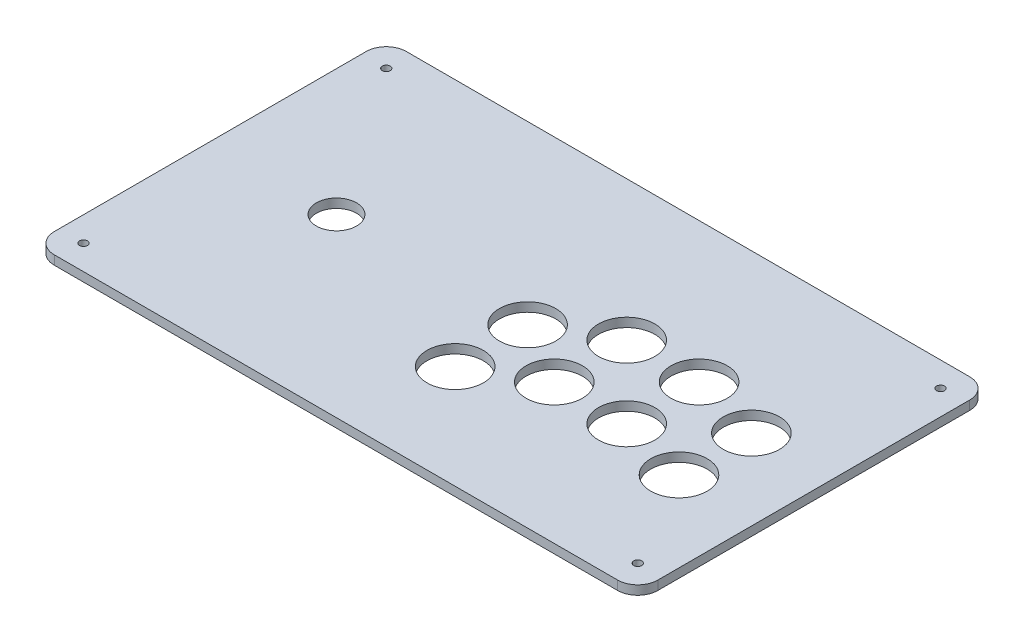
ISO-10303-21;
HEADER;
FILE_DESCRIPTION(('STEP AP214'),'2;1');
FILE_NAME('part.step','',(''),(''),'','','');
FILE_SCHEMA(('AUTOMOTIVE_DESIGN { 1 0 10303 214 1 1 1 1 }'));
ENDSEC;
DATA;
#1=APPLICATION_CONTEXT('core data for automotive mechanical design processes');
#2=APPLICATION_PROTOCOL_DEFINITION('international standard','automotive_design',2000,#1);
#3=PRODUCT_CONTEXT('',#1,'mechanical');
#4=PRODUCT('Part','Part','',(#3));
#5=PRODUCT_RELATED_PRODUCT_CATEGORY('part','',(#4));
#6=PRODUCT_DEFINITION_FORMATION('','',#4);
#7=PRODUCT_DEFINITION_CONTEXT('part definition',#1,'design');
#8=PRODUCT_DEFINITION('design','',#6,#7);
#9=PRODUCT_DEFINITION_SHAPE('','',#8);
#10=(LENGTH_UNIT() NAMED_UNIT(*) SI_UNIT(.MILLI.,.METRE.));
#11=(NAMED_UNIT(*) PLANE_ANGLE_UNIT() SI_UNIT($,.RADIAN.));
#12=(NAMED_UNIT(*) SI_UNIT($,.STERADIAN.) SOLID_ANGLE_UNIT());
#13=UNCERTAINTY_MEASURE_WITH_UNIT(LENGTH_MEASURE(1.E-05),#10,'distance_accuracy_value','');
#14=(GEOMETRIC_REPRESENTATION_CONTEXT(3) GLOBAL_UNCERTAINTY_ASSIGNED_CONTEXT((#13)) GLOBAL_UNIT_ASSIGNED_CONTEXT((#10,
#11,#12)) REPRESENTATION_CONTEXT('',''));
#15=CARTESIAN_POINT('',(0.,0.,0.));
#16=DIRECTION('',(0.,0.,1.));
#17=DIRECTION('',(1.,0.,0.));
#18=AXIS2_PLACEMENT_3D('',#15,#16,#17);
#19=CARTESIAN_POINT('',(140.,4.5,77.5));
#20=DIRECTION('',(0.,1.,0.));
#21=DIRECTION('',(0.,0.,1.));
#22=AXIS2_PLACEMENT_3D('',#19,#20,#21);
#23=PLANE('',#22);
#24=CARTESIAN_POINT('',(137.75,4.5,-75.25));
#25=DIRECTION('',(0.,1.,0.));
#26=DIRECTION('',(0.,0.,1.));
#27=AXIS2_PLACEMENT_3D('',#24,#25,#26);
#28=CIRCLE('',#27,2.);
#29=CARTESIAN_POINT('',(137.75,4.5,-73.25));
#30=VERTEX_POINT('',#29);
#31=EDGE_CURVE('E251',#30,#30,#28,.T.);
#32=ORIENTED_EDGE('',*,*,#31,.F.);
#33=EDGE_LOOP('',(#32));
#34=FACE_BOUND('',#33,.T.);
#35=CARTESIAN_POINT('',(137.75,4.5,75.25));
#36=DIRECTION('',(0.,1.,0.));
#37=DIRECTION('',(0.,0.,1.));
#38=AXIS2_PLACEMENT_3D('',#35,#36,#37);
#39=CIRCLE('',#38,2.);
#40=CARTESIAN_POINT('',(137.75,4.5,77.25));
#41=VERTEX_POINT('',#40);
#42=EDGE_CURVE('E245',#41,#41,#39,.T.);
#43=ORIENTED_EDGE('',*,*,#42,.F.);
#44=EDGE_LOOP('',(#43));
#45=FACE_BOUND('',#44,.T.);
#46=CARTESIAN_POINT('',(-137.75,4.5,75.25));
#47=DIRECTION('',(0.,1.,0.));
#48=DIRECTION('',(0.,0.,1.));
#49=AXIS2_PLACEMENT_3D('',#46,#47,#48);
#50=CIRCLE('',#49,2.);
#51=CARTESIAN_POINT('',(-137.75,4.5,77.25));
#52=VERTEX_POINT('',#51);
#53=EDGE_CURVE('E239',#52,#52,#50,.T.);
#54=ORIENTED_EDGE('',*,*,#53,.F.);
#55=EDGE_LOOP('',(#54));
#56=FACE_BOUND('',#55,.T.);
#57=CARTESIAN_POINT('',(-137.75,4.5,-75.25));
#58=DIRECTION('',(0.,1.,0.));
#59=DIRECTION('',(0.,0.,1.));
#60=AXIS2_PLACEMENT_3D('',#57,#58,#59);
#61=CIRCLE('',#60,2.);
#62=CARTESIAN_POINT('',(-137.75,4.5,-73.25));
#63=VERTEX_POINT('',#62);
#64=EDGE_CURVE('E233',#63,#63,#61,.T.);
#65=ORIENTED_EDGE('',*,*,#64,.F.);
#66=EDGE_LOOP('',(#65));
#67=FACE_BOUND('',#66,.T.);
#68=CARTESIAN_POINT('',(110.,4.5,27.));
#69=DIRECTION('',(0.,1.,0.));
#70=DIRECTION('',(0.,0.,1.));
#71=AXIS2_PLACEMENT_3D('',#68,#69,#70);
#72=CIRCLE('',#71,14.);
#73=CARTESIAN_POINT('',(110.,4.5,41.));
#74=VERTEX_POINT('',#73);
#75=EDGE_CURVE('E218',#74,#74,#72,.T.);
#76=ORIENTED_EDGE('',*,*,#75,.F.);
#77=EDGE_LOOP('',(#76));
#78=FACE_BOUND('',#77,.T.);
#79=CARTESIAN_POINT('',(38.9999999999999,4.5,18.));
#80=DIRECTION('',(0.,1.,0.));
#81=DIRECTION('',(0.,0.,1.));
#82=AXIS2_PLACEMENT_3D('',#79,#80,#81);
#83=CIRCLE('',#82,14.);
#84=CARTESIAN_POINT('',(38.9999999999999,4.5,32.));
#85=VERTEX_POINT('',#84);
#86=EDGE_CURVE('E206',#85,#85,#83,.T.);
#87=ORIENTED_EDGE('',*,*,#86,.F.);
#88=EDGE_LOOP('',(#87));
#89=FACE_BOUND('',#88,.T.);
#90=CARTESIAN_POINT('',(110.,4.5,-9.));
#91=DIRECTION('',(0.,1.,0.));
#92=DIRECTION('',(0.,0.,1.));
#93=AXIS2_PLACEMENT_3D('',#90,#91,#92);
#94=CIRCLE('',#93,14.);
#95=CARTESIAN_POINT('',(110.,4.5,4.99999999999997));
#96=VERTEX_POINT('',#95);
#97=EDGE_CURVE('E194',#96,#96,#94,.T.);
#98=ORIENTED_EDGE('',*,*,#97,.F.);
#99=EDGE_LOOP('',(#98));
#100=FACE_BOUND('',#99,.T.);
#101=CARTESIAN_POINT('',(38.9999999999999,4.5,-18.));
#102=DIRECTION('',(0.,1.,0.));
#103=DIRECTION('',(0.,0.,1.));
#104=AXIS2_PLACEMENT_3D('',#101,#102,#103);
#105=CIRCLE('',#104,14.);
#106=CARTESIAN_POINT('',(38.9999999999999,4.5,-4.));
#107=VERTEX_POINT('',#106);
#108=EDGE_CURVE('E182',#107,#107,#105,.T.);
#109=ORIENTED_EDGE('',*,*,#108,.F.);
#110=EDGE_LOOP('',(#109));
#111=FACE_BOUND('',#110,.T.);
#112=CARTESIAN_POINT('',(140.,4.5,77.5));
#113=DIRECTION('',(0.,1.,0.));
#114=DIRECTION('',(0.,0.,1.));
#115=AXIS2_PLACEMENT_3D('',#112,#113,#114);
#116=CIRCLE('',#115,10.);
#117=CARTESIAN_POINT('',(140.,4.5,87.5));
#118=VERTEX_POINT('',#117);
#119=CARTESIAN_POINT('',(150.,4.5,77.5));
#120=VERTEX_POINT('',#119);
#121=EDGE_CURVE('E145',#118,#120,#116,.T.);
#122=ORIENTED_EDGE('',*,*,#121,.T.);
#123=DIRECTION('',(0.,0.,-1.));
#124=VECTOR('',#123,1.);
#125=CARTESIAN_POINT('',(150.,4.5,77.5));
#126=LINE('',#125,#124);
#127=CARTESIAN_POINT('',(150.,4.5,-77.5));
#128=VERTEX_POINT('',#127);
#129=EDGE_CURVE('E93',#120,#128,#126,.T.);
#130=ORIENTED_EDGE('',*,*,#129,.T.);
#131=CARTESIAN_POINT('',(140.,4.5,-77.5));
#132=DIRECTION('',(0.,1.,0.));
#133=DIRECTION('',(0.,0.,1.));
#134=AXIS2_PLACEMENT_3D('',#131,#132,#133);
#135=CIRCLE('',#134,10.);
#136=CARTESIAN_POINT('',(140.,4.5,-87.5));
#137=VERTEX_POINT('',#136);
#138=EDGE_CURVE('E160',#128,#137,#135,.T.);
#139=ORIENTED_EDGE('',*,*,#138,.T.);
#140=DIRECTION('',(-1.,0.,0.));
#141=VECTOR('',#140,1.);
#142=CARTESIAN_POINT('',(140.,4.5,-87.5));
#143=LINE('',#142,#141);
#144=CARTESIAN_POINT('',(-140.,4.5,-87.5));
#145=VERTEX_POINT('',#144);
#146=EDGE_CURVE('E173',#137,#145,#143,.T.);
#147=ORIENTED_EDGE('',*,*,#146,.T.);
#148=CARTESIAN_POINT('',(-140.,4.5,-77.5));
#149=DIRECTION('',(0.,1.,0.));
#150=DIRECTION('',(0.,0.,1.));
#151=AXIS2_PLACEMENT_3D('',#148,#149,#150);
#152=CIRCLE('',#151,10.);
#153=CARTESIAN_POINT('',(-150.,4.5,-77.5));
#154=VERTEX_POINT('',#153);
#155=EDGE_CURVE('E112',#145,#154,#152,.T.);
#156=ORIENTED_EDGE('',*,*,#155,.T.);
#157=DIRECTION('',(0.,0.,1.));
#158=VECTOR('',#157,1.);
#159=CARTESIAN_POINT('',(-150.,4.5,77.5));
#160=LINE('',#159,#158);
#161=CARTESIAN_POINT('',(-150.,4.5,77.5));
#162=VERTEX_POINT('',#161);
#163=EDGE_CURVE('E106',#154,#162,#160,.T.);
#164=ORIENTED_EDGE('',*,*,#163,.T.);
#165=CARTESIAN_POINT('',(-140.,4.5,77.5));
#166=DIRECTION('',(0.,1.,0.));
#167=DIRECTION('',(0.,0.,-1.));
#168=AXIS2_PLACEMENT_3D('',#165,#166,#167);
#169=CIRCLE('',#168,10.);
#170=CARTESIAN_POINT('',(-140.,4.5,87.5));
#171=VERTEX_POINT('',#170);
#172=EDGE_CURVE('E110',#162,#171,#169,.T.);
#173=ORIENTED_EDGE('',*,*,#172,.T.);
#174=DIRECTION('',(1.,0.,0.));
#175=VECTOR('',#174,1.);
#176=CARTESIAN_POINT('',(140.,4.5,87.5));
#177=LINE('',#176,#175);
#178=EDGE_CURVE('E50',#171,#118,#177,.T.);
#179=ORIENTED_EDGE('',*,*,#178,.T.);
#180=EDGE_LOOP('',(#122,#130,#139,#147,#156,#164,#173,#179));
#181=FACE_BOUND('',#180,.T.);
#182=CARTESIAN_POINT('',(7.74999999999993,4.5,0.));
#183=DIRECTION('',(0.,1.,0.));
#184=DIRECTION('',(0.,0.,1.));
#185=AXIS2_PLACEMENT_3D('',#182,#183,#184);
#186=CIRCLE('',#185,14.);
#187=CARTESIAN_POINT('',(7.74999999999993,4.5,14.));
#188=VERTEX_POINT('',#187);
#189=EDGE_CURVE('E134',#188,#188,#186,.T.);
#190=ORIENTED_EDGE('',*,*,#189,.F.);
#191=EDGE_LOOP('',(#190));
#192=FACE_BOUND('',#191,.T.);
#193=CARTESIAN_POINT('',(74.9999999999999,4.5,-18.));
#194=DIRECTION('',(0.,1.,0.));
#195=DIRECTION('',(0.,0.,1.));
#196=AXIS2_PLACEMENT_3D('',#193,#194,#195);
#197=CIRCLE('',#196,14.);
#198=CARTESIAN_POINT('',(74.9999999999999,4.5,-3.99999999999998));
#199=VERTEX_POINT('',#198);
#200=EDGE_CURVE('E188',#199,#199,#197,.T.);
#201=ORIENTED_EDGE('',*,*,#200,.F.);
#202=EDGE_LOOP('',(#201));
#203=FACE_BOUND('',#202,.T.);
#204=CARTESIAN_POINT('',(7.74999999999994,4.5,36.));
#205=DIRECTION('',(0.,1.,0.));
#206=DIRECTION('',(0.,0.,1.));
#207=AXIS2_PLACEMENT_3D('',#204,#205,#206);
#208=CIRCLE('',#207,14.);
#209=CARTESIAN_POINT('',(7.74999999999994,4.5,50.));
#210=VERTEX_POINT('',#209);
#211=EDGE_CURVE('E200',#210,#210,#208,.T.);
#212=ORIENTED_EDGE('',*,*,#211,.F.);
#213=EDGE_LOOP('',(#212));
#214=FACE_BOUND('',#213,.T.);
#215=CARTESIAN_POINT('',(74.9999999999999,4.5,18.));
#216=DIRECTION('',(0.,1.,0.));
#217=DIRECTION('',(0.,0.,1.));
#218=AXIS2_PLACEMENT_3D('',#215,#216,#217);
#219=CIRCLE('',#218,14.);
#220=CARTESIAN_POINT('',(74.9999999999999,4.5,32.));
#221=VERTEX_POINT('',#220);
#222=EDGE_CURVE('E212',#221,#221,#219,.T.);
#223=ORIENTED_EDGE('',*,*,#222,.F.);
#224=EDGE_LOOP('',(#223));
#225=FACE_BOUND('',#224,.T.);
#226=CARTESIAN_POINT('',(-87.2500000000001,4.5,0.));
#227=DIRECTION('',(0.,1.,0.));
#228=DIRECTION('',(0.,0.,1.));
#229=AXIS2_PLACEMENT_3D('',#226,#227,#228);
#230=CIRCLE('',#229,9.99999999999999);
#231=CARTESIAN_POINT('',(-87.2500000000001,4.5,9.99999999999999));
#232=VERTEX_POINT('',#231);
#233=EDGE_CURVE('E224',#232,#232,#230,.T.);
#234=ORIENTED_EDGE('',*,*,#233,.F.);
#235=EDGE_LOOP('',(#234));
#236=FACE_BOUND('',#235,.T.);
#237=ADVANCED_FACE('F33',(#34,#45,#56,#67,#78,#89,#100,#111,#181,#192,#203,#214,#225,#236),#23,.T.);
#238=CARTESIAN_POINT('',(140.,0.,77.5));
#239=DIRECTION('',(0.,1.,0.));
#240=DIRECTION('',(0.,0.,1.));
#241=AXIS2_PLACEMENT_3D('',#238,#239,#240);
#242=PLANE('',#241);
#243=CARTESIAN_POINT('',(137.75,0.,-75.25));
#244=DIRECTION('',(0.,1.,0.));
#245=DIRECTION('',(0.,0.,1.));
#246=AXIS2_PLACEMENT_3D('',#243,#244,#245);
#247=CIRCLE('',#246,2.);
#248=CARTESIAN_POINT('',(137.75,0.,-73.25));
#249=VERTEX_POINT('',#248);
#250=EDGE_CURVE('E236',#249,#249,#247,.T.);
#251=ORIENTED_EDGE('',*,*,#250,.T.);
#252=EDGE_LOOP('',(#251));
#253=FACE_BOUND('',#252,.T.);
#254=CARTESIAN_POINT('',(137.75,0.,75.25));
#255=DIRECTION('',(0.,1.,0.));
#256=DIRECTION('',(0.,0.,1.));
#257=AXIS2_PLACEMENT_3D('',#254,#255,#256);
#258=CIRCLE('',#257,2.);
#259=CARTESIAN_POINT('',(137.75,0.,77.25));
#260=VERTEX_POINT('',#259);
#261=EDGE_CURVE('E248',#260,#260,#258,.T.);
#262=ORIENTED_EDGE('',*,*,#261,.T.);
#263=EDGE_LOOP('',(#262));
#264=FACE_BOUND('',#263,.T.);
#265=CARTESIAN_POINT('',(-137.75,0.,75.25));
#266=DIRECTION('',(0.,1.,0.));
#267=DIRECTION('',(0.,0.,1.));
#268=AXIS2_PLACEMENT_3D('',#265,#266,#267);
#269=CIRCLE('',#268,2.);
#270=CARTESIAN_POINT('',(-137.75,0.,77.25));
#271=VERTEX_POINT('',#270);
#272=EDGE_CURVE('E242',#271,#271,#269,.T.);
#273=ORIENTED_EDGE('',*,*,#272,.T.);
#274=EDGE_LOOP('',(#273));
#275=FACE_BOUND('',#274,.T.);
#276=CARTESIAN_POINT('',(-137.75,0.,-75.25));
#277=DIRECTION('',(0.,1.,0.));
#278=DIRECTION('',(0.,0.,1.));
#279=AXIS2_PLACEMENT_3D('',#276,#277,#278);
#280=CIRCLE('',#279,2.);
#281=CARTESIAN_POINT('',(-137.75,0.,-73.25));
#282=VERTEX_POINT('',#281);
#283=EDGE_CURVE('E230',#282,#282,#280,.T.);
#284=ORIENTED_EDGE('',*,*,#283,.T.);
#285=EDGE_LOOP('',(#284));
#286=FACE_BOUND('',#285,.T.);
#287=CARTESIAN_POINT('',(140.,0.,77.5));
#288=DIRECTION('',(0.,1.,0.));
#289=DIRECTION('',(0.,0.,1.));
#290=AXIS2_PLACEMENT_3D('',#287,#288,#289);
#291=CIRCLE('',#290,10.);
#292=CARTESIAN_POINT('',(140.,0.,87.5));
#293=VERTEX_POINT('',#292);
#294=CARTESIAN_POINT('',(150.,0.,77.5));
#295=VERTEX_POINT('',#294);
#296=EDGE_CURVE('E130',#293,#295,#291,.T.);
#297=ORIENTED_EDGE('',*,*,#296,.F.);
#298=DIRECTION('',(1.,0.,0.));
#299=VECTOR('',#298,1.);
#300=CARTESIAN_POINT('',(140.,0.,87.5));
#301=LINE('',#300,#299);
#302=CARTESIAN_POINT('',(-140.,0.,87.5));
#303=VERTEX_POINT('',#302);
#304=EDGE_CURVE('E85',#303,#293,#301,.T.);
#305=ORIENTED_EDGE('',*,*,#304,.F.);
#306=CARTESIAN_POINT('',(-140.,0.,77.5));
#307=DIRECTION('',(0.,1.,0.));
#308=DIRECTION('',(0.,0.,-1.));
#309=AXIS2_PLACEMENT_3D('',#306,#307,#308);
#310=CIRCLE('',#309,10.);
#311=CARTESIAN_POINT('',(-150.,0.,77.5));
#312=VERTEX_POINT('',#311);
#313=EDGE_CURVE('E79',#312,#303,#310,.T.);
#314=ORIENTED_EDGE('',*,*,#313,.F.);
#315=DIRECTION('',(0.,0.,1.));
#316=VECTOR('',#315,1.);
#317=CARTESIAN_POINT('',(-150.,0.,77.5));
#318=LINE('',#317,#316);
#319=CARTESIAN_POINT('',(-150.,0.,-77.5));
#320=VERTEX_POINT('',#319);
#321=EDGE_CURVE('E120',#320,#312,#318,.T.);
#322=ORIENTED_EDGE('',*,*,#321,.F.);
#323=CARTESIAN_POINT('',(-140.,0.,-77.5));
#324=DIRECTION('',(0.,1.,0.));
#325=DIRECTION('',(0.,0.,1.));
#326=AXIS2_PLACEMENT_3D('',#323,#324,#325);
#327=CIRCLE('',#326,10.);
#328=CARTESIAN_POINT('',(-140.,0.,-87.5));
#329=VERTEX_POINT('',#328);
#330=EDGE_CURVE('E140',#329,#320,#327,.T.);
#331=ORIENTED_EDGE('',*,*,#330,.F.);
#332=DIRECTION('',(-1.,0.,0.));
#333=VECTOR('',#332,1.);
#334=CARTESIAN_POINT('',(140.,0.,-87.5));
#335=LINE('',#334,#333);
#336=CARTESIAN_POINT('',(140.,0.,-87.5));
#337=VERTEX_POINT('',#336);
#338=EDGE_CURVE('E138',#337,#329,#335,.T.);
#339=ORIENTED_EDGE('',*,*,#338,.F.);
#340=CARTESIAN_POINT('',(140.,0.,-77.5));
#341=DIRECTION('',(0.,1.,0.));
#342=DIRECTION('',(0.,0.,1.));
#343=AXIS2_PLACEMENT_3D('',#340,#341,#342);
#344=CIRCLE('',#343,10.);
#345=CARTESIAN_POINT('',(150.,0.,-77.5));
#346=VERTEX_POINT('',#345);
#347=EDGE_CURVE('E136',#346,#337,#344,.T.);
#348=ORIENTED_EDGE('',*,*,#347,.F.);
#349=DIRECTION('',(0.,0.,-1.));
#350=VECTOR('',#349,1.);
#351=CARTESIAN_POINT('',(150.,0.,77.5));
#352=LINE('',#351,#350);
#353=EDGE_CURVE('E133',#295,#346,#352,.T.);
#354=ORIENTED_EDGE('',*,*,#353,.F.);
#355=EDGE_LOOP('',(#297,#305,#314,#322,#331,#339,#348,#354));
#356=FACE_BOUND('',#355,.T.);
#357=CARTESIAN_POINT('',(7.74999999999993,0.,0.));
#358=DIRECTION('',(0.,1.,0.));
#359=DIRECTION('',(0.,0.,1.));
#360=AXIS2_PLACEMENT_3D('',#357,#358,#359);
#361=CIRCLE('',#360,14.);
#362=CARTESIAN_POINT('',(7.74999999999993,0.,14.));
#363=VERTEX_POINT('',#362);
#364=EDGE_CURVE('E179',#363,#363,#361,.T.);
#365=ORIENTED_EDGE('',*,*,#364,.T.);
#366=EDGE_LOOP('',(#365));
#367=FACE_BOUND('',#366,.T.);
#368=CARTESIAN_POINT('',(38.9999999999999,0.,-18.));
#369=DIRECTION('',(0.,1.,0.));
#370=DIRECTION('',(0.,0.,1.));
#371=AXIS2_PLACEMENT_3D('',#368,#369,#370);
#372=CIRCLE('',#371,14.);
#373=CARTESIAN_POINT('',(38.9999999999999,0.,-4.));
#374=VERTEX_POINT('',#373);
#375=EDGE_CURVE('E185',#374,#374,#372,.T.);
#376=ORIENTED_EDGE('',*,*,#375,.T.);
#377=EDGE_LOOP('',(#376));
#378=FACE_BOUND('',#377,.T.);
#379=CARTESIAN_POINT('',(74.9999999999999,0.,-18.));
#380=DIRECTION('',(0.,1.,0.));
#381=DIRECTION('',(0.,0.,1.));
#382=AXIS2_PLACEMENT_3D('',#379,#380,#381);
#383=CIRCLE('',#382,14.);
#384=CARTESIAN_POINT('',(74.9999999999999,0.,-3.99999999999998));
#385=VERTEX_POINT('',#384);
#386=EDGE_CURVE('E191',#385,#385,#383,.T.);
#387=ORIENTED_EDGE('',*,*,#386,.T.);
#388=EDGE_LOOP('',(#387));
#389=FACE_BOUND('',#388,.T.);
#390=CARTESIAN_POINT('',(110.,0.,-9.));
#391=DIRECTION('',(0.,1.,0.));
#392=DIRECTION('',(0.,0.,1.));
#393=AXIS2_PLACEMENT_3D('',#390,#391,#392);
#394=CIRCLE('',#393,14.);
#395=CARTESIAN_POINT('',(110.,0.,4.99999999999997));
#396=VERTEX_POINT('',#395);
#397=EDGE_CURVE('E197',#396,#396,#394,.T.);
#398=ORIENTED_EDGE('',*,*,#397,.T.);
#399=EDGE_LOOP('',(#398));
#400=FACE_BOUND('',#399,.T.);
#401=CARTESIAN_POINT('',(7.74999999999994,0.,36.));
#402=DIRECTION('',(0.,1.,0.));
#403=DIRECTION('',(0.,0.,1.));
#404=AXIS2_PLACEMENT_3D('',#401,#402,#403);
#405=CIRCLE('',#404,14.);
#406=CARTESIAN_POINT('',(7.74999999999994,0.,50.));
#407=VERTEX_POINT('',#406);
#408=EDGE_CURVE('E203',#407,#407,#405,.T.);
#409=ORIENTED_EDGE('',*,*,#408,.T.);
#410=EDGE_LOOP('',(#409));
#411=FACE_BOUND('',#410,.T.);
#412=CARTESIAN_POINT('',(38.9999999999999,0.,18.));
#413=DIRECTION('',(0.,1.,0.));
#414=DIRECTION('',(0.,0.,1.));
#415=AXIS2_PLACEMENT_3D('',#412,#413,#414);
#416=CIRCLE('',#415,14.);
#417=CARTESIAN_POINT('',(38.9999999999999,0.,32.));
#418=VERTEX_POINT('',#417);
#419=EDGE_CURVE('E209',#418,#418,#416,.T.);
#420=ORIENTED_EDGE('',*,*,#419,.T.);
#421=EDGE_LOOP('',(#420));
#422=FACE_BOUND('',#421,.T.);
#423=CARTESIAN_POINT('',(74.9999999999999,0.,18.));
#424=DIRECTION('',(0.,1.,0.));
#425=DIRECTION('',(0.,0.,1.));
#426=AXIS2_PLACEMENT_3D('',#423,#424,#425);
#427=CIRCLE('',#426,14.);
#428=CARTESIAN_POINT('',(74.9999999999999,0.,32.));
#429=VERTEX_POINT('',#428);
#430=EDGE_CURVE('E215',#429,#429,#427,.T.);
#431=ORIENTED_EDGE('',*,*,#430,.T.);
#432=EDGE_LOOP('',(#431));
#433=FACE_BOUND('',#432,.T.);
#434=CARTESIAN_POINT('',(110.,0.,27.));
#435=DIRECTION('',(0.,1.,0.));
#436=DIRECTION('',(0.,0.,1.));
#437=AXIS2_PLACEMENT_3D('',#434,#435,#436);
#438=CIRCLE('',#437,14.);
#439=CARTESIAN_POINT('',(110.,0.,41.));
#440=VERTEX_POINT('',#439);
#441=EDGE_CURVE('E221',#440,#440,#438,.T.);
#442=ORIENTED_EDGE('',*,*,#441,.T.);
#443=EDGE_LOOP('',(#442));
#444=FACE_BOUND('',#443,.T.);
#445=CARTESIAN_POINT('',(-87.2500000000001,0.,0.));
#446=DIRECTION('',(0.,1.,0.));
#447=DIRECTION('',(0.,0.,1.));
#448=AXIS2_PLACEMENT_3D('',#445,#446,#447);
#449=CIRCLE('',#448,9.99999999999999);
#450=CARTESIAN_POINT('',(-87.2500000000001,0.,9.99999999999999));
#451=VERTEX_POINT('',#450);
#452=EDGE_CURVE('E227',#451,#451,#449,.T.);
#453=ORIENTED_EDGE('',*,*,#452,.T.);
#454=EDGE_LOOP('',(#453));
#455=FACE_BOUND('',#454,.T.);
#456=ADVANCED_FACE('F164',(#253,#264,#275,#286,#356,#367,#378,#389,#400,#411,#422,#433,#444,
#455),#242,.F.);
#457=CARTESIAN_POINT('',(140.,4.5,77.5));
#458=DIRECTION('',(0.,-1.,0.));
#459=DIRECTION('',(0.,0.,-1.));
#460=AXIS2_PLACEMENT_3D('',#457,#458,#459);
#461=CYLINDRICAL_SURFACE('',#460,10.);
#462=ORIENTED_EDGE('',*,*,#296,.T.);
#463=DIRECTION('',(0.,-1.,0.));
#464=VECTOR('',#463,1.);
#465=CARTESIAN_POINT('',(150.,4.5,77.5));
#466=LINE('',#465,#464);
#467=EDGE_CURVE('E11',#120,#295,#466,.T.);
#468=ORIENTED_EDGE('',*,*,#467,.F.);
#469=ORIENTED_EDGE('',*,*,#121,.F.);
#470=DIRECTION('',(0.,-1.,0.));
#471=VECTOR('',#470,1.);
#472=CARTESIAN_POINT('',(140.,4.5,87.5));
#473=LINE('',#472,#471);
#474=EDGE_CURVE('E126',#118,#293,#473,.T.);
#475=ORIENTED_EDGE('',*,*,#474,.T.);
#476=EDGE_LOOP('',(#462,#468,#469,#475));
#477=FACE_BOUND('',#476,.T.);
#478=ADVANCED_FACE('F35',(#477),#461,.T.);
#479=CARTESIAN_POINT('',(150.,4.5,77.5));
#480=DIRECTION('',(-1.,0.,0.));
#481=DIRECTION('',(0.,0.,1.));
#482=AXIS2_PLACEMENT_3D('',#479,#480,#481);
#483=PLANE('',#482);
#484=ORIENTED_EDGE('',*,*,#353,.T.);
#485=DIRECTION('',(0.,-1.,0.));
#486=VECTOR('',#485,1.);
#487=CARTESIAN_POINT('',(150.,4.5,-77.5));
#488=LINE('',#487,#486);
#489=EDGE_CURVE('E42',#128,#346,#488,.T.);
#490=ORIENTED_EDGE('',*,*,#489,.F.);
#491=ORIENTED_EDGE('',*,*,#129,.F.);
#492=ORIENTED_EDGE('',*,*,#467,.T.);
#493=EDGE_LOOP('',(#484,#490,#491,#492));
#494=FACE_BOUND('',#493,.T.);
#495=ADVANCED_FACE('F359',(#494),#483,.F.);
#496=CARTESIAN_POINT('',(140.,4.5,-77.5));
#497=DIRECTION('',(0.,-1.,0.));
#498=DIRECTION('',(0.,0.,-1.));
#499=AXIS2_PLACEMENT_3D('',#496,#497,#498);
#500=CYLINDRICAL_SURFACE('',#499,10.);
#501=ORIENTED_EDGE('',*,*,#347,.T.);
#502=DIRECTION('',(0.,-1.,0.));
#503=VECTOR('',#502,1.);
#504=CARTESIAN_POINT('',(140.,4.5,-87.5));
#505=LINE('',#504,#503);
#506=EDGE_CURVE('E152',#137,#337,#505,.T.);
#507=ORIENTED_EDGE('',*,*,#506,.F.);
#508=ORIENTED_EDGE('',*,*,#138,.F.);
#509=ORIENTED_EDGE('',*,*,#489,.T.);
#510=EDGE_LOOP('',(#501,#507,#508,#509));
#511=FACE_BOUND('',#510,.T.);
#512=ADVANCED_FACE('F158',(#511),#500,.T.);
#513=CARTESIAN_POINT('',(140.,4.5,-87.5));
#514=DIRECTION('',(0.,0.,1.));
#515=DIRECTION('',(1.,0.,0.));
#516=AXIS2_PLACEMENT_3D('',#513,#514,#515);
#517=PLANE('',#516);
#518=ORIENTED_EDGE('',*,*,#338,.T.);
#519=DIRECTION('',(0.,-1.,0.));
#520=VECTOR('',#519,1.);
#521=CARTESIAN_POINT('',(-140.,4.5,-87.5));
#522=LINE('',#521,#520);
#523=EDGE_CURVE('E149',#145,#329,#522,.T.);
#524=ORIENTED_EDGE('',*,*,#523,.F.);
#525=ORIENTED_EDGE('',*,*,#146,.F.);
#526=ORIENTED_EDGE('',*,*,#506,.T.);
#527=EDGE_LOOP('',(#518,#524,#525,#526));
#528=FACE_BOUND('',#527,.T.);
#529=ADVANCED_FACE('F169',(#528),#517,.F.);
#530=CARTESIAN_POINT('',(-140.,4.5,-77.5));
#531=DIRECTION('',(0.,-1.,0.));
#532=DIRECTION('',(0.,0.,-1.));
#533=AXIS2_PLACEMENT_3D('',#530,#531,#532);
#534=CYLINDRICAL_SURFACE('',#533,10.);
#535=ORIENTED_EDGE('',*,*,#330,.T.);
#536=DIRECTION('',(0.,-1.,0.));
#537=VECTOR('',#536,1.);
#538=CARTESIAN_POINT('',(-150.,4.5,-77.5));
#539=LINE('',#538,#537);
#540=EDGE_CURVE('E121',#154,#320,#539,.T.);
#541=ORIENTED_EDGE('',*,*,#540,.F.);
#542=ORIENTED_EDGE('',*,*,#155,.F.);
#543=ORIENTED_EDGE('',*,*,#523,.T.);
#544=EDGE_LOOP('',(#535,#541,#542,#543));
#545=FACE_BOUND('',#544,.T.);
#546=ADVANCED_FACE('F172',(#545),#534,.T.);
#547=CARTESIAN_POINT('',(-150.,4.5,77.5));
#548=DIRECTION('',(1.,0.,0.));
#549=DIRECTION('',(0.,0.,-1.));
#550=AXIS2_PLACEMENT_3D('',#547,#548,#549);
#551=PLANE('',#550);
#552=ORIENTED_EDGE('',*,*,#321,.T.);
#553=DIRECTION('',(0.,-1.,0.));
#554=VECTOR('',#553,1.);
#555=CARTESIAN_POINT('',(-150.,4.5,77.5));
#556=LINE('',#555,#554);
#557=EDGE_CURVE('E117',#162,#312,#556,.T.);
#558=ORIENTED_EDGE('',*,*,#557,.F.);
#559=ORIENTED_EDGE('',*,*,#163,.F.);
#560=ORIENTED_EDGE('',*,*,#540,.T.);
#561=EDGE_LOOP('',(#552,#558,#559,#560));
#562=FACE_BOUND('',#561,.T.);
#563=ADVANCED_FACE('F118',(#562),#551,.F.);
#564=CARTESIAN_POINT('',(-140.,4.5,77.5));
#565=DIRECTION('',(0.,-1.,0.));
#566=DIRECTION('',(0.,0.,-1.));
#567=AXIS2_PLACEMENT_3D('',#564,#565,#566);
#568=CYLINDRICAL_SURFACE('',#567,10.);
#569=ORIENTED_EDGE('',*,*,#313,.T.);
#570=DIRECTION('',(0.,-1.,0.));
#571=VECTOR('',#570,1.);
#572=CARTESIAN_POINT('',(-140.,4.5,87.5));
#573=LINE('',#572,#571);
#574=EDGE_CURVE('E122',#171,#303,#573,.T.);
#575=ORIENTED_EDGE('',*,*,#574,.F.);
#576=ORIENTED_EDGE('',*,*,#172,.F.);
#577=ORIENTED_EDGE('',*,*,#557,.T.);
#578=EDGE_LOOP('',(#569,#575,#576,#577));
#579=FACE_BOUND('',#578,.T.);
#580=ADVANCED_FACE('F124',(#579),#568,.T.);
#581=CARTESIAN_POINT('',(140.,4.5,87.5));
#582=DIRECTION('',(0.,0.,-1.));
#583=DIRECTION('',(-1.,0.,0.));
#584=AXIS2_PLACEMENT_3D('',#581,#582,#583);
#585=PLANE('',#584);
#586=ORIENTED_EDGE('',*,*,#304,.T.);
#587=ORIENTED_EDGE('',*,*,#474,.F.);
#588=ORIENTED_EDGE('',*,*,#178,.F.);
#589=ORIENTED_EDGE('',*,*,#574,.T.);
#590=EDGE_LOOP('',(#586,#587,#588,#589));
#591=FACE_BOUND('',#590,.T.);
#592=ADVANCED_FACE('F345',(#591),#585,.F.);
#593=CARTESIAN_POINT('',(7.74999999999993,4.5,0.));
#594=DIRECTION('',(0.,-1.,0.));
#595=DIRECTION('',(0.,0.,-1.));
#596=AXIS2_PLACEMENT_3D('',#593,#594,#595);
#597=CYLINDRICAL_SURFACE('',#596,14.);
#598=ORIENTED_EDGE('',*,*,#189,.T.);
#599=EDGE_LOOP('',(#598));
#600=FACE_BOUND('',#599,.T.);
#601=ORIENTED_EDGE('',*,*,#364,.F.);
#602=EDGE_LOOP('',(#601));
#603=FACE_BOUND('',#602,.T.);
#604=ADVANCED_FACE('F287',(#600,#603),#597,.F.);
#605=CARTESIAN_POINT('',(38.9999999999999,4.5,-18.));
#606=DIRECTION('',(0.,-1.,0.));
#607=DIRECTION('',(0.,0.,-1.));
#608=AXIS2_PLACEMENT_3D('',#605,#606,#607);
#609=CYLINDRICAL_SURFACE('',#608,14.);
#610=ORIENTED_EDGE('',*,*,#108,.T.);
#611=EDGE_LOOP('',(#610));
#612=FACE_BOUND('',#611,.T.);
#613=ORIENTED_EDGE('',*,*,#375,.F.);
#614=EDGE_LOOP('',(#613));
#615=FACE_BOUND('',#614,.T.);
#616=ADVANCED_FACE('F283',(#612,#615),#609,.F.);
#617=CARTESIAN_POINT('',(74.9999999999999,4.5,-18.));
#618=DIRECTION('',(0.,-1.,0.));
#619=DIRECTION('',(0.,0.,-1.));
#620=AXIS2_PLACEMENT_3D('',#617,#618,#619);
#621=CYLINDRICAL_SURFACE('',#620,14.);
#622=ORIENTED_EDGE('',*,*,#200,.T.);
#623=EDGE_LOOP('',(#622));
#624=FACE_BOUND('',#623,.T.);
#625=ORIENTED_EDGE('',*,*,#386,.F.);
#626=EDGE_LOOP('',(#625));
#627=FACE_BOUND('',#626,.T.);
#628=ADVANCED_FACE('F286',(#624,#627),#621,.F.);
#629=CARTESIAN_POINT('',(110.,4.5,-9.));
#630=DIRECTION('',(0.,-1.,0.));
#631=DIRECTION('',(0.,0.,-1.));
#632=AXIS2_PLACEMENT_3D('',#629,#630,#631);
#633=CYLINDRICAL_SURFACE('',#632,14.);
#634=ORIENTED_EDGE('',*,*,#97,.T.);
#635=EDGE_LOOP('',(#634));
#636=FACE_BOUND('',#635,.T.);
#637=ORIENTED_EDGE('',*,*,#397,.F.);
#638=EDGE_LOOP('',(#637));
#639=FACE_BOUND('',#638,.T.);
#640=ADVANCED_FACE('F336',(#636,#639),#633,.F.);
#641=CARTESIAN_POINT('',(7.74999999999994,4.5,36.));
#642=DIRECTION('',(0.,-1.,0.));
#643=DIRECTION('',(0.,0.,-1.));
#644=AXIS2_PLACEMENT_3D('',#641,#642,#643);
#645=CYLINDRICAL_SURFACE('',#644,14.);
#646=ORIENTED_EDGE('',*,*,#211,.T.);
#647=EDGE_LOOP('',(#646));
#648=FACE_BOUND('',#647,.T.);
#649=ORIENTED_EDGE('',*,*,#408,.F.);
#650=EDGE_LOOP('',(#649));
#651=FACE_BOUND('',#650,.T.);
#652=ADVANCED_FACE('F332',(#648,#651),#645,.F.);
#653=CARTESIAN_POINT('',(38.9999999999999,4.5,18.));
#654=DIRECTION('',(0.,-1.,0.));
#655=DIRECTION('',(0.,0.,-1.));
#656=AXIS2_PLACEMENT_3D('',#653,#654,#655);
#657=CYLINDRICAL_SURFACE('',#656,14.);
#658=ORIENTED_EDGE('',*,*,#86,.T.);
#659=EDGE_LOOP('',(#658));
#660=FACE_BOUND('',#659,.T.);
#661=ORIENTED_EDGE('',*,*,#419,.F.);
#662=EDGE_LOOP('',(#661));
#663=FACE_BOUND('',#662,.T.);
#664=ADVANCED_FACE('F328',(#660,#663),#657,.F.);
#665=CARTESIAN_POINT('',(74.9999999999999,4.5,18.));
#666=DIRECTION('',(0.,-1.,0.));
#667=DIRECTION('',(0.,0.,-1.));
#668=AXIS2_PLACEMENT_3D('',#665,#666,#667);
#669=CYLINDRICAL_SURFACE('',#668,14.);
#670=ORIENTED_EDGE('',*,*,#222,.T.);
#671=EDGE_LOOP('',(#670));
#672=FACE_BOUND('',#671,.T.);
#673=ORIENTED_EDGE('',*,*,#430,.F.);
#674=EDGE_LOOP('',(#673));
#675=FACE_BOUND('',#674,.T.);
#676=ADVANCED_FACE('F321',(#672,#675),#669,.F.);
#677=CARTESIAN_POINT('',(110.,4.5,27.));
#678=DIRECTION('',(0.,-1.,0.));
#679=DIRECTION('',(0.,0.,-1.));
#680=AXIS2_PLACEMENT_3D('',#677,#678,#679);
#681=CYLINDRICAL_SURFACE('',#680,14.);
#682=ORIENTED_EDGE('',*,*,#75,.T.);
#683=EDGE_LOOP('',(#682));
#684=FACE_BOUND('',#683,.T.);
#685=ORIENTED_EDGE('',*,*,#441,.F.);
#686=EDGE_LOOP('',(#685));
#687=FACE_BOUND('',#686,.T.);
#688=ADVANCED_FACE('F311',(#684,#687),#681,.F.);
#689=CARTESIAN_POINT('',(-87.2500000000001,4.5,0.));
#690=DIRECTION('',(0.,-1.,0.));
#691=DIRECTION('',(0.,0.,-1.));
#692=AXIS2_PLACEMENT_3D('',#689,#690,#691);
#693=CYLINDRICAL_SURFACE('',#692,9.99999999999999);
#694=ORIENTED_EDGE('',*,*,#233,.T.);
#695=EDGE_LOOP('',(#694));
#696=FACE_BOUND('',#695,.T.);
#697=ORIENTED_EDGE('',*,*,#452,.F.);
#698=EDGE_LOOP('',(#697));
#699=FACE_BOUND('',#698,.T.);
#700=ADVANCED_FACE('F308',(#696,#699),#693,.F.);
#701=CARTESIAN_POINT('',(-137.75,0.,-75.25));
#702=DIRECTION('',(0.,1.,0.));
#703=DIRECTION('',(0.,0.,1.));
#704=AXIS2_PLACEMENT_3D('',#701,#702,#703);
#705=CYLINDRICAL_SURFACE('',#704,2.);
#706=ORIENTED_EDGE('',*,*,#283,.F.);
#707=EDGE_LOOP('',(#706));
#708=FACE_BOUND('',#707,.T.);
#709=ORIENTED_EDGE('',*,*,#64,.T.);
#710=EDGE_LOOP('',(#709));
#711=FACE_BOUND('',#710,.T.);
#712=ADVANCED_FACE('F310',(#708,#711),#705,.F.);
#713=CARTESIAN_POINT('',(-137.75,0.,75.25));
#714=DIRECTION('',(0.,1.,0.));
#715=DIRECTION('',(0.,0.,1.));
#716=AXIS2_PLACEMENT_3D('',#713,#714,#715);
#717=CYLINDRICAL_SURFACE('',#716,2.);
#718=ORIENTED_EDGE('',*,*,#272,.F.);
#719=EDGE_LOOP('',(#718));
#720=FACE_BOUND('',#719,.T.);
#721=ORIENTED_EDGE('',*,*,#53,.T.);
#722=EDGE_LOOP('',(#721));
#723=FACE_BOUND('',#722,.T.);
#724=ADVANCED_FACE('F318',(#720,#723),#717,.F.);
#725=CARTESIAN_POINT('',(137.75,0.,75.25));
#726=DIRECTION('',(0.,1.,0.));
#727=DIRECTION('',(0.,0.,1.));
#728=AXIS2_PLACEMENT_3D('',#725,#726,#727);
#729=CYLINDRICAL_SURFACE('',#728,2.);
#730=ORIENTED_EDGE('',*,*,#261,.F.);
#731=EDGE_LOOP('',(#730));
#732=FACE_BOUND('',#731,.T.);
#733=ORIENTED_EDGE('',*,*,#42,.T.);
#734=EDGE_LOOP('',(#733));
#735=FACE_BOUND('',#734,.T.);
#736=ADVANCED_FACE('F262',(#732,#735),#729,.F.);
#737=CARTESIAN_POINT('',(137.75,0.,-75.25));
#738=DIRECTION('',(0.,1.,0.));
#739=DIRECTION('',(0.,0.,1.));
#740=AXIS2_PLACEMENT_3D('',#737,#738,#739);
#741=CYLINDRICAL_SURFACE('',#740,2.);
#742=ORIENTED_EDGE('',*,*,#250,.F.);
#743=EDGE_LOOP('',(#742));
#744=FACE_BOUND('',#743,.T.);
#745=ORIENTED_EDGE('',*,*,#31,.T.);
#746=EDGE_LOOP('',(#745));
#747=FACE_BOUND('',#746,.T.);
#748=ADVANCED_FACE('F259',(#744,#747),#741,.F.);
#749=CLOSED_SHELL('',(#237,#456,#478,#495,#512,#529,#546,#563,#580,#592,#604,#616,#628,#640,
#652,#664,#676,#688,#700,#712,#724,#736,#748));
#750=MANIFOLD_SOLID_BREP('B2',#749);
#751=ADVANCED_BREP_SHAPE_REPRESENTATION('',(#18,#750),#14);
#752=SHAPE_DEFINITION_REPRESENTATION(#9,#751);
ENDSEC;
END-ISO-10303-21;
